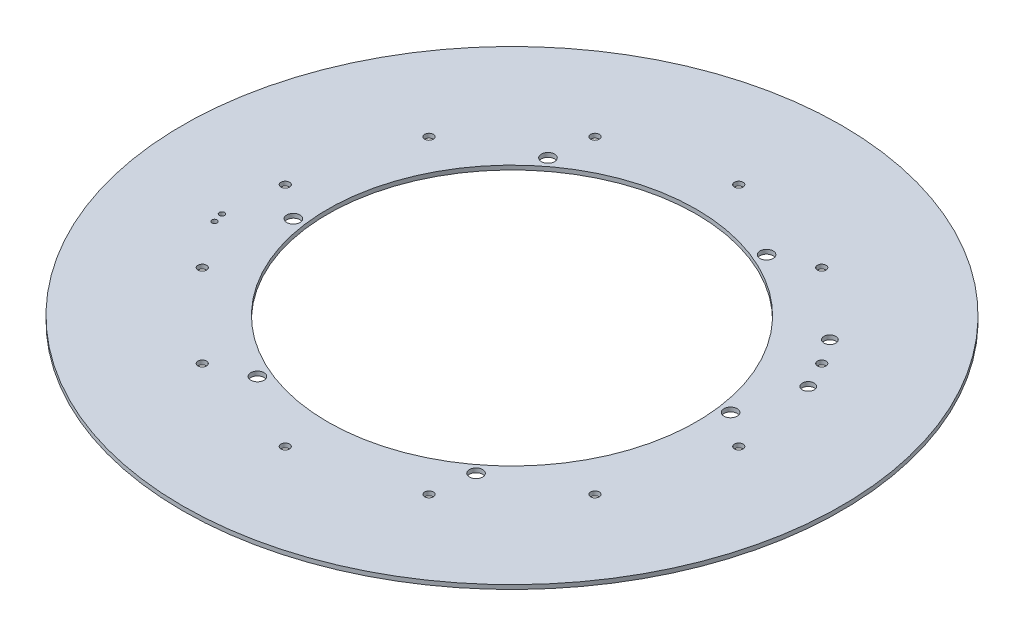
ISO-10303-21;
HEADER;
FILE_DESCRIPTION(('STEP AP214'),'2;1');
FILE_NAME('part.step','',(''),(''),'','','');
FILE_SCHEMA(('AUTOMOTIVE_DESIGN { 1 0 10303 214 1 1 1 1 }'));
ENDSEC;
DATA;
#1=APPLICATION_CONTEXT('core data for automotive mechanical design processes');
#2=APPLICATION_PROTOCOL_DEFINITION('international standard','automotive_design',2000,#1);
#3=PRODUCT_CONTEXT('',#1,'mechanical');
#4=PRODUCT('Part','Part','',(#3));
#5=PRODUCT_RELATED_PRODUCT_CATEGORY('part','',(#4));
#6=PRODUCT_DEFINITION_FORMATION('','',#4);
#7=PRODUCT_DEFINITION_CONTEXT('part definition',#1,'design');
#8=PRODUCT_DEFINITION('design','',#6,#7);
#9=PRODUCT_DEFINITION_SHAPE('','',#8);
#10=(LENGTH_UNIT() NAMED_UNIT(*) SI_UNIT(.MILLI.,.METRE.));
#11=(NAMED_UNIT(*) PLANE_ANGLE_UNIT() SI_UNIT($,.RADIAN.));
#12=(NAMED_UNIT(*) SI_UNIT($,.STERADIAN.) SOLID_ANGLE_UNIT());
#13=UNCERTAINTY_MEASURE_WITH_UNIT(LENGTH_MEASURE(1.E-05),#10,'distance_accuracy_value','');
#14=(GEOMETRIC_REPRESENTATION_CONTEXT(3) GLOBAL_UNCERTAINTY_ASSIGNED_CONTEXT((#13)) GLOBAL_UNIT_ASSIGNED_CONTEXT((#10,
#11,#12)) REPRESENTATION_CONTEXT('',''));
#15=CARTESIAN_POINT('',(0.,0.,0.));
#16=DIRECTION('',(0.,0.,1.));
#17=DIRECTION('',(1.,0.,0.));
#18=AXIS2_PLACEMENT_3D('',#15,#16,#17);
#19=CARTESIAN_POINT('',(0.,1.6,0.));
#20=DIRECTION('',(0.,1.,0.));
#21=DIRECTION('',(0.,0.,1.));
#22=AXIS2_PLACEMENT_3D('',#19,#20,#21);
#23=PLANE('',#22);
#24=CARTESIAN_POINT('',(-88.3956565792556,1.6,21.6149924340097));
#25=DIRECTION('',(0.,1.,0.));
#26=DIRECTION('',(0.,0.,1.));
#27=AXIS2_PLACEMENT_3D('',#24,#25,#26);
#28=CIRCLE('',#27,1.);
#29=CARTESIAN_POINT('',(-88.3956565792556,1.6,22.6149924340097));
#30=VERTEX_POINT('',#29);
#31=EDGE_CURVE('E179',#30,#30,#28,.T.);
#32=ORIENTED_EDGE('',*,*,#31,.F.);
#33=EDGE_LOOP('',(#32));
#34=FACE_BOUND('',#33,.T.);
#35=CARTESIAN_POINT('',(-87.3603803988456,1.6,25.4786957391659));
#36=DIRECTION('',(0.,1.,0.));
#37=DIRECTION('',(0.,0.,1.));
#38=AXIS2_PLACEMENT_3D('',#35,#36,#37);
#39=CIRCLE('',#38,1.);
#40=CARTESIAN_POINT('',(-87.3603803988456,1.6,26.4786957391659));
#41=VERTEX_POINT('',#40);
#42=EDGE_CURVE('E173',#41,#41,#39,.T.);
#43=ORIENTED_EDGE('',*,*,#42,.F.);
#44=EDGE_LOOP('',(#43));
#45=FACE_BOUND('',#44,.T.);
#46=CARTESIAN_POINT('',(79.4536397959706,1.6,-32.9107751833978));
#47=DIRECTION('',(0.,1.,0.));
#48=DIRECTION('',(0.,0.,1.));
#49=AXIS2_PLACEMENT_3D('',#46,#47,#48);
#50=CIRCLE('',#49,2.2479);
#51=CARTESIAN_POINT('',(79.4536397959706,1.6,-30.6628751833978));
#52=VERTEX_POINT('',#51);
#53=EDGE_CURVE('E167',#52,#52,#50,.T.);
#54=ORIENTED_EDGE('',*,*,#53,.F.);
#55=EDGE_LOOP('',(#54));
#56=FACE_BOUND('',#55,.T.);
#57=CARTESIAN_POINT('',(68.2283872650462,1.6,-52.3534828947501));
#58=DIRECTION('',(0.,1.,0.));
#59=DIRECTION('',(0.,0.,1.));
#60=AXIS2_PLACEMENT_3D('',#57,#58,#59);
#61=CIRCLE('',#60,2.2479);
#62=CARTESIAN_POINT('',(68.2283872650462,1.6,-50.1055828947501));
#63=VERTEX_POINT('',#62);
#64=EDGE_CURVE('E161',#63,#63,#61,.T.);
#65=ORIENTED_EDGE('',*,*,#64,.F.);
#66=EDGE_LOOP('',(#65));
#67=FACE_BOUND('',#66,.T.);
#68=CARTESIAN_POINT('',(73.2677752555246,1.6,-9.64588560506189));
#69=DIRECTION('',(0.,1.,0.));
#70=DIRECTION('',(0.,0.,1.));
#71=AXIS2_PLACEMENT_3D('',#68,#69,#70);
#72=CIRCLE('',#71,2.5);
#73=CARTESIAN_POINT('',(73.2677752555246,1.6,-7.14588560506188));
#74=VERTEX_POINT('',#73);
#75=EDGE_CURVE('E155',#74,#74,#72,.T.);
#76=ORIENTED_EDGE('',*,*,#75,.F.);
#77=EDGE_LOOP('',(#76));
#78=FACE_BOUND('',#77,.T.);
#79=CARTESIAN_POINT('',(44.9874696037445,1.6,58.6288118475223));
#80=DIRECTION('',(0.,1.,0.));
#81=DIRECTION('',(0.,0.,1.));
#82=AXIS2_PLACEMENT_3D('',#79,#80,#81);
#83=CIRCLE('',#82,2.5);
#84=CARTESIAN_POINT('',(44.9874696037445,1.6,61.1288118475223));
#85=VERTEX_POINT('',#84);
#86=EDGE_CURVE('E149',#85,#85,#83,.T.);
#87=ORIENTED_EDGE('',*,*,#86,.F.);
#88=EDGE_LOOP('',(#87));
#89=FACE_BOUND('',#88,.T.);
#90=CARTESIAN_POINT('',(-28.2803056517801,1.6,68.2746974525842));
#91=DIRECTION('',(0.,1.,0.));
#92=DIRECTION('',(0.,0.,1.));
#93=AXIS2_PLACEMENT_3D('',#90,#91,#92);
#94=CIRCLE('',#93,2.5);
#95=CARTESIAN_POINT('',(-28.2803056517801,1.6,70.7746974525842));
#96=VERTEX_POINT('',#95);
#97=EDGE_CURVE('E143',#96,#96,#94,.T.);
#98=ORIENTED_EDGE('',*,*,#97,.F.);
#99=EDGE_LOOP('',(#98));
#100=FACE_BOUND('',#99,.T.);
#101=CARTESIAN_POINT('',(-73.2677752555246,1.6,9.64588560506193));
#102=DIRECTION('',(0.,1.,0.));
#103=DIRECTION('',(0.,0.,1.));
#104=AXIS2_PLACEMENT_3D('',#101,#102,#103);
#105=CIRCLE('',#104,2.5);
#106=CARTESIAN_POINT('',(-73.2677752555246,1.6,12.1458856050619));
#107=VERTEX_POINT('',#106);
#108=EDGE_CURVE('E137',#107,#107,#105,.T.);
#109=ORIENTED_EDGE('',*,*,#108,.F.);
#110=EDGE_LOOP('',(#109));
#111=FACE_BOUND('',#110,.T.);
#112=CARTESIAN_POINT('',(-44.9874696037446,1.6,-58.6288118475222));
#113=DIRECTION('',(0.,1.,0.));
#114=DIRECTION('',(0.,0.,1.));
#115=AXIS2_PLACEMENT_3D('',#112,#113,#114);
#116=CIRCLE('',#115,2.5);
#117=CARTESIAN_POINT('',(-44.9874696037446,1.6,-56.1288118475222));
#118=VERTEX_POINT('',#117);
#119=EDGE_CURVE('E131',#118,#118,#116,.T.);
#120=ORIENTED_EDGE('',*,*,#119,.F.);
#121=EDGE_LOOP('',(#120));
#122=FACE_BOUND('',#121,.T.);
#123=CARTESIAN_POINT('',(28.2803056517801,1.6,-68.2746974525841));
#124=DIRECTION('',(0.,1.,0.));
#125=DIRECTION('',(0.,0.,1.));
#126=AXIS2_PLACEMENT_3D('',#123,#124,#125);
#127=CIRCLE('',#126,2.5);
#128=CARTESIAN_POINT('',(28.2803056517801,1.6,-65.7746974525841));
#129=VERTEX_POINT('',#128);
#130=EDGE_CURVE('E125',#129,#129,#127,.T.);
#131=ORIENTED_EDGE('',*,*,#130,.F.);
#132=EDGE_LOOP('',(#131));
#133=FACE_BOUND('',#132,.T.);
#134=CARTESIAN_POINT('',(86.,1.6,0.));
#135=DIRECTION('',(0.,1.,0.));
#136=DIRECTION('',(0.,0.,1.));
#137=AXIS2_PLACEMENT_3D('',#134,#135,#136);
#138=CIRCLE('',#137,1.63194999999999);
#139=CARTESIAN_POINT('',(86.,1.6,1.63194999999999));
#140=VERTEX_POINT('',#139);
#141=EDGE_CURVE('E119',#140,#140,#138,.T.);
#142=ORIENTED_EDGE('',*,*,#141,.F.);
#143=EDGE_LOOP('',(#142));
#144=FACE_BOUND('',#143,.T.);
#145=CARTESIAN_POINT('',(74.4781847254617,1.6,43.));
#146=DIRECTION('',(0.,1.,0.));
#147=DIRECTION('',(0.,0.,1.));
#148=AXIS2_PLACEMENT_3D('',#145,#146,#147);
#149=CIRCLE('',#148,1.63194999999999);
#150=CARTESIAN_POINT('',(74.4781847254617,1.6,44.63195));
#151=VERTEX_POINT('',#150);
#152=EDGE_CURVE('E113',#151,#151,#149,.T.);
#153=ORIENTED_EDGE('',*,*,#152,.F.);
#154=EDGE_LOOP('',(#153));
#155=FACE_BOUND('',#154,.T.);
#156=CARTESIAN_POINT('',(42.9999999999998,1.6,74.4781847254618));
#157=DIRECTION('',(0.,1.,0.));
#158=DIRECTION('',(0.,0.,1.));
#159=AXIS2_PLACEMENT_3D('',#156,#157,#158);
#160=CIRCLE('',#159,1.63194999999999);
#161=CARTESIAN_POINT('',(42.9999999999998,1.6,76.1101347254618));
#162=VERTEX_POINT('',#161);
#163=EDGE_CURVE('E107',#162,#162,#160,.T.);
#164=ORIENTED_EDGE('',*,*,#163,.F.);
#165=EDGE_LOOP('',(#164));
#166=FACE_BOUND('',#165,.T.);
#167=CARTESIAN_POINT('',(-3.00267395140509E-13,1.6,86.));
#168=DIRECTION('',(0.,1.,0.));
#169=DIRECTION('',(0.,0.,1.));
#170=AXIS2_PLACEMENT_3D('',#167,#168,#169);
#171=CIRCLE('',#170,1.63195);
#172=CARTESIAN_POINT('',(-3.00267395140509E-13,1.6,87.63195));
#173=VERTEX_POINT('',#172);
#174=EDGE_CURVE('E101',#173,#173,#171,.T.);
#175=ORIENTED_EDGE('',*,*,#174,.F.);
#176=EDGE_LOOP('',(#175));
#177=FACE_BOUND('',#176,.T.);
#178=CARTESIAN_POINT('',(-43.0000000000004,1.6,74.4781847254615));
#179=DIRECTION('',(0.,1.,0.));
#180=DIRECTION('',(0.,0.,1.));
#181=AXIS2_PLACEMENT_3D('',#178,#179,#180);
#182=CIRCLE('',#181,1.63194999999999);
#183=CARTESIAN_POINT('',(-43.0000000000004,1.6,76.1101347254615));
#184=VERTEX_POINT('',#183);
#185=EDGE_CURVE('E95',#184,#184,#182,.T.);
#186=ORIENTED_EDGE('',*,*,#185,.F.);
#187=EDGE_LOOP('',(#186));
#188=FACE_BOUND('',#187,.T.);
#189=CARTESIAN_POINT('',(-74.4781847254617,1.6,43.));
#190=DIRECTION('',(0.,1.,0.));
#191=DIRECTION('',(0.,0.,1.));
#192=AXIS2_PLACEMENT_3D('',#189,#190,#191);
#193=CIRCLE('',#192,1.63194999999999);
#194=CARTESIAN_POINT('',(-74.4781847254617,1.6,44.63195));
#195=VERTEX_POINT('',#194);
#196=EDGE_CURVE('E89',#195,#195,#193,.T.);
#197=ORIENTED_EDGE('',*,*,#196,.F.);
#198=EDGE_LOOP('',(#197));
#199=FACE_BOUND('',#198,.T.);
#200=CARTESIAN_POINT('',(-86.,1.6,-6.00534790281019E-13));
#201=DIRECTION('',(0.,1.,0.));
#202=DIRECTION('',(0.,0.,1.));
#203=AXIS2_PLACEMENT_3D('',#200,#201,#202);
#204=CIRCLE('',#203,1.63194999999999);
#205=CARTESIAN_POINT('',(-86.,1.6,1.63194999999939));
#206=VERTEX_POINT('',#205);
#207=EDGE_CURVE('E83',#206,#206,#204,.T.);
#208=ORIENTED_EDGE('',*,*,#207,.F.);
#209=EDGE_LOOP('',(#208));
#210=FACE_BOUND('',#209,.T.);
#211=CARTESIAN_POINT('',(-74.4781847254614,1.6,-43.0000000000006));
#212=DIRECTION('',(0.,1.,0.));
#213=DIRECTION('',(0.,0.,1.));
#214=AXIS2_PLACEMENT_3D('',#211,#212,#213);
#215=CIRCLE('',#214,1.63194999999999);
#216=CARTESIAN_POINT('',(-74.4781847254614,1.6,-41.3680500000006));
#217=VERTEX_POINT('',#216);
#218=EDGE_CURVE('E77',#217,#217,#215,.T.);
#219=ORIENTED_EDGE('',*,*,#218,.F.);
#220=EDGE_LOOP('',(#219));
#221=FACE_BOUND('',#220,.T.);
#222=CARTESIAN_POINT('',(-42.9999999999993,1.6,-74.4781847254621));
#223=DIRECTION('',(0.,1.,0.));
#224=DIRECTION('',(0.,0.,1.));
#225=AXIS2_PLACEMENT_3D('',#222,#223,#224);
#226=CIRCLE('',#225,1.63194999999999);
#227=CARTESIAN_POINT('',(-42.9999999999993,1.6,-72.8462347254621));
#228=VERTEX_POINT('',#227);
#229=EDGE_CURVE('E71',#228,#228,#226,.T.);
#230=ORIENTED_EDGE('',*,*,#229,.F.);
#231=EDGE_LOOP('',(#230));
#232=FACE_BOUND('',#231,.T.);
#233=CARTESIAN_POINT('',(9.00802185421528E-13,1.6,-86.));
#234=DIRECTION('',(0.,1.,0.));
#235=DIRECTION('',(0.,0.,1.));
#236=AXIS2_PLACEMENT_3D('',#233,#234,#235);
#237=CIRCLE('',#236,1.63195);
#238=CARTESIAN_POINT('',(9.00802185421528E-13,1.6,-84.36805));
#239=VERTEX_POINT('',#238);
#240=EDGE_CURVE('E65',#239,#239,#237,.T.);
#241=ORIENTED_EDGE('',*,*,#240,.F.);
#242=EDGE_LOOP('',(#241));
#243=FACE_BOUND('',#242,.T.);
#244=CARTESIAN_POINT('',(43.0000000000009,1.6,-74.4781847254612));
#245=DIRECTION('',(0.,1.,0.));
#246=DIRECTION('',(0.,0.,1.));
#247=AXIS2_PLACEMENT_3D('',#244,#245,#246);
#248=CIRCLE('',#247,1.63194999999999);
#249=CARTESIAN_POINT('',(43.0000000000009,1.6,-72.8462347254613));
#250=VERTEX_POINT('',#249);
#251=EDGE_CURVE('E59',#250,#250,#248,.T.);
#252=ORIENTED_EDGE('',*,*,#251,.F.);
#253=EDGE_LOOP('',(#252));
#254=FACE_BOUND('',#253,.T.);
#255=CARTESIAN_POINT('',(74.4781847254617,1.6,-43.));
#256=DIRECTION('',(0.,1.,0.));
#257=DIRECTION('',(0.,0.,1.));
#258=AXIS2_PLACEMENT_3D('',#255,#256,#257);
#259=CIRCLE('',#258,1.63194999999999);
#260=CARTESIAN_POINT('',(74.4781847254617,1.6,-41.36805));
#261=VERTEX_POINT('',#260);
#262=EDGE_CURVE('E53',#261,#261,#259,.T.);
#263=ORIENTED_EDGE('',*,*,#262,.F.);
#264=EDGE_LOOP('',(#263));
#265=FACE_BOUND('',#264,.T.);
#266=CARTESIAN_POINT('',(0.,1.6,0.));
#267=DIRECTION('',(0.,1.,0.));
#268=DIRECTION('',(0.,0.,1.));
#269=AXIS2_PLACEMENT_3D('',#266,#267,#268);
#270=CIRCLE('',#269,125.);
#271=CARTESIAN_POINT('',(0.,1.6,125.));
#272=VERTEX_POINT('',#271);
#273=EDGE_CURVE('E10',#272,#272,#270,.T.);
#274=ORIENTED_EDGE('',*,*,#273,.T.);
#275=EDGE_LOOP('',(#274));
#276=FACE_BOUND('',#275,.T.);
#277=CARTESIAN_POINT('',(0.,1.6,0.));
#278=DIRECTION('',(0.,1.,0.));
#279=DIRECTION('',(0.,0.,1.));
#280=AXIS2_PLACEMENT_3D('',#277,#278,#279);
#281=CIRCLE('',#280,69.9);
#282=CARTESIAN_POINT('',(0.,1.6,69.9));
#283=VERTEX_POINT('',#282);
#284=EDGE_CURVE('E43',#283,#283,#281,.T.);
#285=ORIENTED_EDGE('',*,*,#284,.F.);
#286=EDGE_LOOP('',(#285));
#287=FACE_BOUND('',#286,.T.);
#288=ADVANCED_FACE('F32',(#34,#45,#56,#67,#78,#89,#100,#111,#122,#133,#144,#155,#166,#177,#188,
#199,#210,#221,#232,#243,#254,#265,#276,#287),#23,.T.);
#289=CARTESIAN_POINT('',(0.,0.,0.));
#290=DIRECTION('',(0.,1.,0.));
#291=DIRECTION('',(0.,0.,1.));
#292=AXIS2_PLACEMENT_3D('',#289,#290,#291);
#293=PLANE('',#292);
#294=CARTESIAN_POINT('',(-88.3956565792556,0.,21.6149924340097));
#295=DIRECTION('',(0.,1.,0.));
#296=DIRECTION('',(0.,0.,1.));
#297=AXIS2_PLACEMENT_3D('',#294,#295,#296);
#298=CIRCLE('',#297,1.);
#299=CARTESIAN_POINT('',(-88.3956565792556,0.,22.6149924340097));
#300=VERTEX_POINT('',#299);
#301=EDGE_CURVE('E176',#300,#300,#298,.T.);
#302=ORIENTED_EDGE('',*,*,#301,.T.);
#303=EDGE_LOOP('',(#302));
#304=FACE_BOUND('',#303,.T.);
#305=CARTESIAN_POINT('',(-87.3603803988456,0.,25.4786957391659));
#306=DIRECTION('',(0.,1.,0.));
#307=DIRECTION('',(0.,0.,1.));
#308=AXIS2_PLACEMENT_3D('',#305,#306,#307);
#309=CIRCLE('',#308,1.);
#310=CARTESIAN_POINT('',(-87.3603803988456,0.,26.4786957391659));
#311=VERTEX_POINT('',#310);
#312=EDGE_CURVE('E170',#311,#311,#309,.T.);
#313=ORIENTED_EDGE('',*,*,#312,.T.);
#314=EDGE_LOOP('',(#313));
#315=FACE_BOUND('',#314,.T.);
#316=CARTESIAN_POINT('',(79.4536397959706,0.,-32.9107751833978));
#317=DIRECTION('',(0.,1.,0.));
#318=DIRECTION('',(0.,0.,1.));
#319=AXIS2_PLACEMENT_3D('',#316,#317,#318);
#320=CIRCLE('',#319,2.2479);
#321=CARTESIAN_POINT('',(79.4536397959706,0.,-30.6628751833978));
#322=VERTEX_POINT('',#321);
#323=EDGE_CURVE('E164',#322,#322,#320,.T.);
#324=ORIENTED_EDGE('',*,*,#323,.T.);
#325=EDGE_LOOP('',(#324));
#326=FACE_BOUND('',#325,.T.);
#327=CARTESIAN_POINT('',(68.2283872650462,0.,-52.3534828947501));
#328=DIRECTION('',(0.,1.,0.));
#329=DIRECTION('',(0.,0.,1.));
#330=AXIS2_PLACEMENT_3D('',#327,#328,#329);
#331=CIRCLE('',#330,2.2479);
#332=CARTESIAN_POINT('',(68.2283872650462,0.,-50.1055828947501));
#333=VERTEX_POINT('',#332);
#334=EDGE_CURVE('E158',#333,#333,#331,.T.);
#335=ORIENTED_EDGE('',*,*,#334,.T.);
#336=EDGE_LOOP('',(#335));
#337=FACE_BOUND('',#336,.T.);
#338=CARTESIAN_POINT('',(73.2677752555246,0.,-9.64588560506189));
#339=DIRECTION('',(0.,1.,0.));
#340=DIRECTION('',(0.,0.,1.));
#341=AXIS2_PLACEMENT_3D('',#338,#339,#340);
#342=CIRCLE('',#341,2.5);
#343=CARTESIAN_POINT('',(73.2677752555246,0.,-7.14588560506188));
#344=VERTEX_POINT('',#343);
#345=EDGE_CURVE('E152',#344,#344,#342,.T.);
#346=ORIENTED_EDGE('',*,*,#345,.T.);
#347=EDGE_LOOP('',(#346));
#348=FACE_BOUND('',#347,.T.);
#349=CARTESIAN_POINT('',(44.9874696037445,0.,58.6288118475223));
#350=DIRECTION('',(0.,1.,0.));
#351=DIRECTION('',(0.,0.,1.));
#352=AXIS2_PLACEMENT_3D('',#349,#350,#351);
#353=CIRCLE('',#352,2.5);
#354=CARTESIAN_POINT('',(44.9874696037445,0.,61.1288118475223));
#355=VERTEX_POINT('',#354);
#356=EDGE_CURVE('E146',#355,#355,#353,.T.);
#357=ORIENTED_EDGE('',*,*,#356,.T.);
#358=EDGE_LOOP('',(#357));
#359=FACE_BOUND('',#358,.T.);
#360=CARTESIAN_POINT('',(-28.2803056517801,0.,68.2746974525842));
#361=DIRECTION('',(0.,1.,0.));
#362=DIRECTION('',(0.,0.,1.));
#363=AXIS2_PLACEMENT_3D('',#360,#361,#362);
#364=CIRCLE('',#363,2.5);
#365=CARTESIAN_POINT('',(-28.2803056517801,0.,70.7746974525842));
#366=VERTEX_POINT('',#365);
#367=EDGE_CURVE('E140',#366,#366,#364,.T.);
#368=ORIENTED_EDGE('',*,*,#367,.T.);
#369=EDGE_LOOP('',(#368));
#370=FACE_BOUND('',#369,.T.);
#371=CARTESIAN_POINT('',(-73.2677752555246,0.,9.64588560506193));
#372=DIRECTION('',(0.,1.,0.));
#373=DIRECTION('',(0.,0.,1.));
#374=AXIS2_PLACEMENT_3D('',#371,#372,#373);
#375=CIRCLE('',#374,2.5);
#376=CARTESIAN_POINT('',(-73.2677752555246,0.,12.1458856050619));
#377=VERTEX_POINT('',#376);
#378=EDGE_CURVE('E134',#377,#377,#375,.T.);
#379=ORIENTED_EDGE('',*,*,#378,.T.);
#380=EDGE_LOOP('',(#379));
#381=FACE_BOUND('',#380,.T.);
#382=CARTESIAN_POINT('',(-44.9874696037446,0.,-58.6288118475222));
#383=DIRECTION('',(0.,1.,0.));
#384=DIRECTION('',(0.,0.,1.));
#385=AXIS2_PLACEMENT_3D('',#382,#383,#384);
#386=CIRCLE('',#385,2.5);
#387=CARTESIAN_POINT('',(-44.9874696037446,0.,-56.1288118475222));
#388=VERTEX_POINT('',#387);
#389=EDGE_CURVE('E128',#388,#388,#386,.T.);
#390=ORIENTED_EDGE('',*,*,#389,.T.);
#391=EDGE_LOOP('',(#390));
#392=FACE_BOUND('',#391,.T.);
#393=CARTESIAN_POINT('',(28.2803056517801,0.,-68.2746974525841));
#394=DIRECTION('',(0.,1.,0.));
#395=DIRECTION('',(0.,0.,1.));
#396=AXIS2_PLACEMENT_3D('',#393,#394,#395);
#397=CIRCLE('',#396,2.5);
#398=CARTESIAN_POINT('',(28.2803056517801,0.,-65.7746974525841));
#399=VERTEX_POINT('',#398);
#400=EDGE_CURVE('E122',#399,#399,#397,.T.);
#401=ORIENTED_EDGE('',*,*,#400,.T.);
#402=EDGE_LOOP('',(#401));
#403=FACE_BOUND('',#402,.T.);
#404=CARTESIAN_POINT('',(86.,0.,0.));
#405=DIRECTION('',(0.,1.,0.));
#406=DIRECTION('',(0.,0.,1.));
#407=AXIS2_PLACEMENT_3D('',#404,#405,#406);
#408=CIRCLE('',#407,1.63194999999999);
#409=CARTESIAN_POINT('',(86.,0.,1.63194999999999));
#410=VERTEX_POINT('',#409);
#411=EDGE_CURVE('E116',#410,#410,#408,.T.);
#412=ORIENTED_EDGE('',*,*,#411,.T.);
#413=EDGE_LOOP('',(#412));
#414=FACE_BOUND('',#413,.T.);
#415=CARTESIAN_POINT('',(74.4781847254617,0.,43.));
#416=DIRECTION('',(0.,1.,0.));
#417=DIRECTION('',(0.,0.,1.));
#418=AXIS2_PLACEMENT_3D('',#415,#416,#417);
#419=CIRCLE('',#418,1.63194999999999);
#420=CARTESIAN_POINT('',(74.4781847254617,0.,44.63195));
#421=VERTEX_POINT('',#420);
#422=EDGE_CURVE('E110',#421,#421,#419,.T.);
#423=ORIENTED_EDGE('',*,*,#422,.T.);
#424=EDGE_LOOP('',(#423));
#425=FACE_BOUND('',#424,.T.);
#426=CARTESIAN_POINT('',(42.9999999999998,0.,74.4781847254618));
#427=DIRECTION('',(0.,1.,0.));
#428=DIRECTION('',(0.,0.,1.));
#429=AXIS2_PLACEMENT_3D('',#426,#427,#428);
#430=CIRCLE('',#429,1.63194999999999);
#431=CARTESIAN_POINT('',(42.9999999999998,0.,76.1101347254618));
#432=VERTEX_POINT('',#431);
#433=EDGE_CURVE('E104',#432,#432,#430,.T.);
#434=ORIENTED_EDGE('',*,*,#433,.T.);
#435=EDGE_LOOP('',(#434));
#436=FACE_BOUND('',#435,.T.);
#437=CARTESIAN_POINT('',(-3.00267395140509E-13,0.,86.));
#438=DIRECTION('',(0.,1.,0.));
#439=DIRECTION('',(0.,0.,1.));
#440=AXIS2_PLACEMENT_3D('',#437,#438,#439);
#441=CIRCLE('',#440,1.63195);
#442=CARTESIAN_POINT('',(-3.00267395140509E-13,0.,87.63195));
#443=VERTEX_POINT('',#442);
#444=EDGE_CURVE('E98',#443,#443,#441,.T.);
#445=ORIENTED_EDGE('',*,*,#444,.T.);
#446=EDGE_LOOP('',(#445));
#447=FACE_BOUND('',#446,.T.);
#448=CARTESIAN_POINT('',(-43.0000000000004,0.,74.4781847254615));
#449=DIRECTION('',(0.,1.,0.));
#450=DIRECTION('',(0.,0.,1.));
#451=AXIS2_PLACEMENT_3D('',#448,#449,#450);
#452=CIRCLE('',#451,1.63194999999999);
#453=CARTESIAN_POINT('',(-43.0000000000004,0.,76.1101347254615));
#454=VERTEX_POINT('',#453);
#455=EDGE_CURVE('E92',#454,#454,#452,.T.);
#456=ORIENTED_EDGE('',*,*,#455,.T.);
#457=EDGE_LOOP('',(#456));
#458=FACE_BOUND('',#457,.T.);
#459=CARTESIAN_POINT('',(-74.4781847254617,0.,43.));
#460=DIRECTION('',(0.,1.,0.));
#461=DIRECTION('',(0.,0.,1.));
#462=AXIS2_PLACEMENT_3D('',#459,#460,#461);
#463=CIRCLE('',#462,1.63194999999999);
#464=CARTESIAN_POINT('',(-74.4781847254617,0.,44.63195));
#465=VERTEX_POINT('',#464);
#466=EDGE_CURVE('E86',#465,#465,#463,.T.);
#467=ORIENTED_EDGE('',*,*,#466,.T.);
#468=EDGE_LOOP('',(#467));
#469=FACE_BOUND('',#468,.T.);
#470=CARTESIAN_POINT('',(-86.,0.,-6.00534790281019E-13));
#471=DIRECTION('',(0.,1.,0.));
#472=DIRECTION('',(0.,0.,1.));
#473=AXIS2_PLACEMENT_3D('',#470,#471,#472);
#474=CIRCLE('',#473,1.63194999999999);
#475=CARTESIAN_POINT('',(-86.,0.,1.63194999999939));
#476=VERTEX_POINT('',#475);
#477=EDGE_CURVE('E80',#476,#476,#474,.T.);
#478=ORIENTED_EDGE('',*,*,#477,.T.);
#479=EDGE_LOOP('',(#478));
#480=FACE_BOUND('',#479,.T.);
#481=CARTESIAN_POINT('',(-74.4781847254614,0.,-43.0000000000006));
#482=DIRECTION('',(0.,1.,0.));
#483=DIRECTION('',(0.,0.,1.));
#484=AXIS2_PLACEMENT_3D('',#481,#482,#483);
#485=CIRCLE('',#484,1.63194999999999);
#486=CARTESIAN_POINT('',(-74.4781847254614,0.,-41.3680500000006));
#487=VERTEX_POINT('',#486);
#488=EDGE_CURVE('E74',#487,#487,#485,.T.);
#489=ORIENTED_EDGE('',*,*,#488,.T.);
#490=EDGE_LOOP('',(#489));
#491=FACE_BOUND('',#490,.T.);
#492=CARTESIAN_POINT('',(-42.9999999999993,0.,-74.4781847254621));
#493=DIRECTION('',(0.,1.,0.));
#494=DIRECTION('',(0.,0.,1.));
#495=AXIS2_PLACEMENT_3D('',#492,#493,#494);
#496=CIRCLE('',#495,1.63194999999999);
#497=CARTESIAN_POINT('',(-42.9999999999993,0.,-72.8462347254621));
#498=VERTEX_POINT('',#497);
#499=EDGE_CURVE('E68',#498,#498,#496,.T.);
#500=ORIENTED_EDGE('',*,*,#499,.T.);
#501=EDGE_LOOP('',(#500));
#502=FACE_BOUND('',#501,.T.);
#503=CARTESIAN_POINT('',(9.00802185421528E-13,0.,-86.));
#504=DIRECTION('',(0.,1.,0.));
#505=DIRECTION('',(0.,0.,1.));
#506=AXIS2_PLACEMENT_3D('',#503,#504,#505);
#507=CIRCLE('',#506,1.63195);
#508=CARTESIAN_POINT('',(9.00802185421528E-13,0.,-84.36805));
#509=VERTEX_POINT('',#508);
#510=EDGE_CURVE('E62',#509,#509,#507,.T.);
#511=ORIENTED_EDGE('',*,*,#510,.T.);
#512=EDGE_LOOP('',(#511));
#513=FACE_BOUND('',#512,.T.);
#514=CARTESIAN_POINT('',(43.0000000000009,0.,-74.4781847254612));
#515=DIRECTION('',(0.,1.,0.));
#516=DIRECTION('',(0.,0.,1.));
#517=AXIS2_PLACEMENT_3D('',#514,#515,#516);
#518=CIRCLE('',#517,1.63194999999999);
#519=CARTESIAN_POINT('',(43.0000000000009,0.,-72.8462347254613));
#520=VERTEX_POINT('',#519);
#521=EDGE_CURVE('E56',#520,#520,#518,.T.);
#522=ORIENTED_EDGE('',*,*,#521,.T.);
#523=EDGE_LOOP('',(#522));
#524=FACE_BOUND('',#523,.T.);
#525=CARTESIAN_POINT('',(74.4781847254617,0.,-43.));
#526=DIRECTION('',(0.,1.,0.));
#527=DIRECTION('',(0.,0.,1.));
#528=AXIS2_PLACEMENT_3D('',#525,#526,#527);
#529=CIRCLE('',#528,1.63194999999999);
#530=CARTESIAN_POINT('',(74.4781847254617,0.,-41.36805));
#531=VERTEX_POINT('',#530);
#532=EDGE_CURVE('E48',#531,#531,#529,.T.);
#533=ORIENTED_EDGE('',*,*,#532,.T.);
#534=EDGE_LOOP('',(#533));
#535=FACE_BOUND('',#534,.T.);
#536=CARTESIAN_POINT('',(0.,0.,0.));
#537=DIRECTION('',(0.,1.,0.));
#538=DIRECTION('',(0.,0.,1.));
#539=AXIS2_PLACEMENT_3D('',#536,#537,#538);
#540=CIRCLE('',#539,125.);
#541=CARTESIAN_POINT('',(0.,0.,125.));
#542=VERTEX_POINT('',#541);
#543=EDGE_CURVE('E36',#542,#542,#540,.T.);
#544=ORIENTED_EDGE('',*,*,#543,.F.);
#545=EDGE_LOOP('',(#544));
#546=FACE_BOUND('',#545,.T.);
#547=CARTESIAN_POINT('',(0.,0.,0.));
#548=DIRECTION('',(0.,1.,0.));
#549=DIRECTION('',(0.,0.,1.));
#550=AXIS2_PLACEMENT_3D('',#547,#548,#549);
#551=CIRCLE('',#550,69.9);
#552=CARTESIAN_POINT('',(0.,0.,69.9));
#553=VERTEX_POINT('',#552);
#554=EDGE_CURVE('E45',#553,#553,#551,.T.);
#555=ORIENTED_EDGE('',*,*,#554,.T.);
#556=EDGE_LOOP('',(#555));
#557=FACE_BOUND('',#556,.T.);
#558=ADVANCED_FACE('F187',(#304,#315,#326,#337,#348,#359,#370,#381,#392,#403,#414,#425,#436,
#447,#458,#469,#480,#491,#502,#513,#524,#535,#546,#557),#293,.F.);
#559=CARTESIAN_POINT('',(0.,1.6,0.));
#560=DIRECTION('',(0.,-1.,0.));
#561=DIRECTION('',(0.,0.,-1.));
#562=AXIS2_PLACEMENT_3D('',#559,#560,#561);
#563=CYLINDRICAL_SURFACE('',#562,125.);
#564=ORIENTED_EDGE('',*,*,#273,.F.);
#565=EDGE_LOOP('',(#564));
#566=FACE_BOUND('',#565,.T.);
#567=ORIENTED_EDGE('',*,*,#543,.T.);
#568=EDGE_LOOP('',(#567));
#569=FACE_BOUND('',#568,.T.);
#570=ADVANCED_FACE('F34',(#566,#569),#563,.T.);
#571=CARTESIAN_POINT('',(0.,1.6,0.));
#572=DIRECTION('',(0.,-1.,0.));
#573=DIRECTION('',(0.,0.,-1.));
#574=AXIS2_PLACEMENT_3D('',#571,#572,#573);
#575=CYLINDRICAL_SURFACE('',#574,69.9);
#576=ORIENTED_EDGE('',*,*,#284,.T.);
#577=EDGE_LOOP('',(#576));
#578=FACE_BOUND('',#577,.T.);
#579=ORIENTED_EDGE('',*,*,#554,.F.);
#580=EDGE_LOOP('',(#579));
#581=FACE_BOUND('',#580,.T.);
#582=ADVANCED_FACE('F233',(#578,#581),#575,.F.);
#583=CARTESIAN_POINT('',(74.4781847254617,1.6,-43.));
#584=DIRECTION('',(0.,1.,0.));
#585=DIRECTION('',(0.,0.,1.));
#586=AXIS2_PLACEMENT_3D('',#583,#584,#585);
#587=CYLINDRICAL_SURFACE('',#586,1.63194999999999);
#588=ORIENTED_EDGE('',*,*,#532,.F.);
#589=EDGE_LOOP('',(#588));
#590=FACE_BOUND('',#589,.T.);
#591=ORIENTED_EDGE('',*,*,#262,.T.);
#592=EDGE_LOOP('',(#591));
#593=FACE_BOUND('',#592,.T.);
#594=ADVANCED_FACE('F236',(#590,#593),#587,.F.);
#595=CARTESIAN_POINT('',(43.0000000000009,1.6,-74.4781847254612));
#596=DIRECTION('',(0.,1.,0.));
#597=DIRECTION('',(0.,0.,1.));
#598=AXIS2_PLACEMENT_3D('',#595,#596,#597);
#599=CYLINDRICAL_SURFACE('',#598,1.63194999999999);
#600=ORIENTED_EDGE('',*,*,#521,.F.);
#601=EDGE_LOOP('',(#600));
#602=FACE_BOUND('',#601,.T.);
#603=ORIENTED_EDGE('',*,*,#251,.T.);
#604=EDGE_LOOP('',(#603));
#605=FACE_BOUND('',#604,.T.);
#606=ADVANCED_FACE('F250',(#602,#605),#599,.F.);
#607=CARTESIAN_POINT('',(9.00802185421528E-13,1.6,-86.));
#608=DIRECTION('',(0.,1.,0.));
#609=DIRECTION('',(0.,0.,1.));
#610=AXIS2_PLACEMENT_3D('',#607,#608,#609);
#611=CYLINDRICAL_SURFACE('',#610,1.63195);
#612=ORIENTED_EDGE('',*,*,#510,.F.);
#613=EDGE_LOOP('',(#612));
#614=FACE_BOUND('',#613,.T.);
#615=ORIENTED_EDGE('',*,*,#240,.T.);
#616=EDGE_LOOP('',(#615));
#617=FACE_BOUND('',#616,.T.);
#618=ADVANCED_FACE('F254',(#614,#617),#611,.F.);
#619=CARTESIAN_POINT('',(-42.9999999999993,1.6,-74.4781847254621));
#620=DIRECTION('',(0.,1.,0.));
#621=DIRECTION('',(0.,0.,1.));
#622=AXIS2_PLACEMENT_3D('',#619,#620,#621);
#623=CYLINDRICAL_SURFACE('',#622,1.63194999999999);
#624=ORIENTED_EDGE('',*,*,#499,.F.);
#625=EDGE_LOOP('',(#624));
#626=FACE_BOUND('',#625,.T.);
#627=ORIENTED_EDGE('',*,*,#229,.T.);
#628=EDGE_LOOP('',(#627));
#629=FACE_BOUND('',#628,.T.);
#630=ADVANCED_FACE('F258',(#626,#629),#623,.F.);
#631=CARTESIAN_POINT('',(-74.4781847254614,1.6,-43.0000000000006));
#632=DIRECTION('',(0.,1.,0.));
#633=DIRECTION('',(0.,0.,1.));
#634=AXIS2_PLACEMENT_3D('',#631,#632,#633);
#635=CYLINDRICAL_SURFACE('',#634,1.63194999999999);
#636=ORIENTED_EDGE('',*,*,#488,.F.);
#637=EDGE_LOOP('',(#636));
#638=FACE_BOUND('',#637,.T.);
#639=ORIENTED_EDGE('',*,*,#218,.T.);
#640=EDGE_LOOP('',(#639));
#641=FACE_BOUND('',#640,.T.);
#642=ADVANCED_FACE('F262',(#638,#641),#635,.F.);
#643=CARTESIAN_POINT('',(-86.,1.6,-6.00534790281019E-13));
#644=DIRECTION('',(0.,1.,0.));
#645=DIRECTION('',(0.,0.,1.));
#646=AXIS2_PLACEMENT_3D('',#643,#644,#645);
#647=CYLINDRICAL_SURFACE('',#646,1.63194999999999);
#648=ORIENTED_EDGE('',*,*,#477,.F.);
#649=EDGE_LOOP('',(#648));
#650=FACE_BOUND('',#649,.T.);
#651=ORIENTED_EDGE('',*,*,#207,.T.);
#652=EDGE_LOOP('',(#651));
#653=FACE_BOUND('',#652,.T.);
#654=ADVANCED_FACE('F266',(#650,#653),#647,.F.);
#655=CARTESIAN_POINT('',(-74.4781847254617,1.6,43.));
#656=DIRECTION('',(0.,1.,0.));
#657=DIRECTION('',(0.,0.,1.));
#658=AXIS2_PLACEMENT_3D('',#655,#656,#657);
#659=CYLINDRICAL_SURFACE('',#658,1.63194999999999);
#660=ORIENTED_EDGE('',*,*,#466,.F.);
#661=EDGE_LOOP('',(#660));
#662=FACE_BOUND('',#661,.T.);
#663=ORIENTED_EDGE('',*,*,#196,.T.);
#664=EDGE_LOOP('',(#663));
#665=FACE_BOUND('',#664,.T.);
#666=ADVANCED_FACE('F270',(#662,#665),#659,.F.);
#667=CARTESIAN_POINT('',(-43.0000000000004,1.6,74.4781847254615));
#668=DIRECTION('',(0.,1.,0.));
#669=DIRECTION('',(0.,0.,1.));
#670=AXIS2_PLACEMENT_3D('',#667,#668,#669);
#671=CYLINDRICAL_SURFACE('',#670,1.63194999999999);
#672=ORIENTED_EDGE('',*,*,#455,.F.);
#673=EDGE_LOOP('',(#672));
#674=FACE_BOUND('',#673,.T.);
#675=ORIENTED_EDGE('',*,*,#185,.T.);
#676=EDGE_LOOP('',(#675));
#677=FACE_BOUND('',#676,.T.);
#678=ADVANCED_FACE('F274',(#674,#677),#671,.F.);
#679=CARTESIAN_POINT('',(-3.00267395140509E-13,1.6,86.));
#680=DIRECTION('',(0.,1.,0.));
#681=DIRECTION('',(0.,0.,1.));
#682=AXIS2_PLACEMENT_3D('',#679,#680,#681);
#683=CYLINDRICAL_SURFACE('',#682,1.63195);
#684=ORIENTED_EDGE('',*,*,#444,.F.);
#685=EDGE_LOOP('',(#684));
#686=FACE_BOUND('',#685,.T.);
#687=ORIENTED_EDGE('',*,*,#174,.T.);
#688=EDGE_LOOP('',(#687));
#689=FACE_BOUND('',#688,.T.);
#690=ADVANCED_FACE('F278',(#686,#689),#683,.F.);
#691=CARTESIAN_POINT('',(42.9999999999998,1.6,74.4781847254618));
#692=DIRECTION('',(0.,1.,0.));
#693=DIRECTION('',(0.,0.,1.));
#694=AXIS2_PLACEMENT_3D('',#691,#692,#693);
#695=CYLINDRICAL_SURFACE('',#694,1.63194999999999);
#696=ORIENTED_EDGE('',*,*,#433,.F.);
#697=EDGE_LOOP('',(#696));
#698=FACE_BOUND('',#697,.T.);
#699=ORIENTED_EDGE('',*,*,#163,.T.);
#700=EDGE_LOOP('',(#699));
#701=FACE_BOUND('',#700,.T.);
#702=ADVANCED_FACE('F282',(#698,#701),#695,.F.);
#703=CARTESIAN_POINT('',(74.4781847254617,1.6,43.));
#704=DIRECTION('',(0.,1.,0.));
#705=DIRECTION('',(0.,0.,1.));
#706=AXIS2_PLACEMENT_3D('',#703,#704,#705);
#707=CYLINDRICAL_SURFACE('',#706,1.63194999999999);
#708=ORIENTED_EDGE('',*,*,#422,.F.);
#709=EDGE_LOOP('',(#708));
#710=FACE_BOUND('',#709,.T.);
#711=ORIENTED_EDGE('',*,*,#152,.T.);
#712=EDGE_LOOP('',(#711));
#713=FACE_BOUND('',#712,.T.);
#714=ADVANCED_FACE('F286',(#710,#713),#707,.F.);
#715=CARTESIAN_POINT('',(86.,1.6,0.));
#716=DIRECTION('',(0.,1.,0.));
#717=DIRECTION('',(0.,0.,1.));
#718=AXIS2_PLACEMENT_3D('',#715,#716,#717);
#719=CYLINDRICAL_SURFACE('',#718,1.63194999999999);
#720=ORIENTED_EDGE('',*,*,#411,.F.);
#721=EDGE_LOOP('',(#720));
#722=FACE_BOUND('',#721,.T.);
#723=ORIENTED_EDGE('',*,*,#141,.T.);
#724=EDGE_LOOP('',(#723));
#725=FACE_BOUND('',#724,.T.);
#726=ADVANCED_FACE('F290',(#722,#725),#719,.F.);
#727=CARTESIAN_POINT('',(28.2803056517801,1.6,-68.2746974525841));
#728=DIRECTION('',(0.,1.,0.));
#729=DIRECTION('',(0.,0.,1.));
#730=AXIS2_PLACEMENT_3D('',#727,#728,#729);
#731=CYLINDRICAL_SURFACE('',#730,2.5);
#732=ORIENTED_EDGE('',*,*,#400,.F.);
#733=EDGE_LOOP('',(#732));
#734=FACE_BOUND('',#733,.T.);
#735=ORIENTED_EDGE('',*,*,#130,.T.);
#736=EDGE_LOOP('',(#735));
#737=FACE_BOUND('',#736,.T.);
#738=ADVANCED_FACE('F294',(#734,#737),#731,.F.);
#739=CARTESIAN_POINT('',(-44.9874696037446,1.6,-58.6288118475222));
#740=DIRECTION('',(0.,1.,0.));
#741=DIRECTION('',(0.,0.,1.));
#742=AXIS2_PLACEMENT_3D('',#739,#740,#741);
#743=CYLINDRICAL_SURFACE('',#742,2.5);
#744=ORIENTED_EDGE('',*,*,#389,.F.);
#745=EDGE_LOOP('',(#744));
#746=FACE_BOUND('',#745,.T.);
#747=ORIENTED_EDGE('',*,*,#119,.T.);
#748=EDGE_LOOP('',(#747));
#749=FACE_BOUND('',#748,.T.);
#750=ADVANCED_FACE('F298',(#746,#749),#743,.F.);
#751=CARTESIAN_POINT('',(-73.2677752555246,1.6,9.64588560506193));
#752=DIRECTION('',(0.,1.,0.));
#753=DIRECTION('',(0.,0.,1.));
#754=AXIS2_PLACEMENT_3D('',#751,#752,#753);
#755=CYLINDRICAL_SURFACE('',#754,2.5);
#756=ORIENTED_EDGE('',*,*,#378,.F.);
#757=EDGE_LOOP('',(#756));
#758=FACE_BOUND('',#757,.T.);
#759=ORIENTED_EDGE('',*,*,#108,.T.);
#760=EDGE_LOOP('',(#759));
#761=FACE_BOUND('',#760,.T.);
#762=ADVANCED_FACE('F302',(#758,#761),#755,.F.);
#763=CARTESIAN_POINT('',(-28.2803056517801,1.6,68.2746974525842));
#764=DIRECTION('',(0.,1.,0.));
#765=DIRECTION('',(0.,0.,1.));
#766=AXIS2_PLACEMENT_3D('',#763,#764,#765);
#767=CYLINDRICAL_SURFACE('',#766,2.5);
#768=ORIENTED_EDGE('',*,*,#367,.F.);
#769=EDGE_LOOP('',(#768));
#770=FACE_BOUND('',#769,.T.);
#771=ORIENTED_EDGE('',*,*,#97,.T.);
#772=EDGE_LOOP('',(#771));
#773=FACE_BOUND('',#772,.T.);
#774=ADVANCED_FACE('F306',(#770,#773),#767,.F.);
#775=CARTESIAN_POINT('',(44.9874696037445,1.6,58.6288118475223));
#776=DIRECTION('',(0.,1.,0.));
#777=DIRECTION('',(0.,0.,1.));
#778=AXIS2_PLACEMENT_3D('',#775,#776,#777);
#779=CYLINDRICAL_SURFACE('',#778,2.5);
#780=ORIENTED_EDGE('',*,*,#356,.F.);
#781=EDGE_LOOP('',(#780));
#782=FACE_BOUND('',#781,.T.);
#783=ORIENTED_EDGE('',*,*,#86,.T.);
#784=EDGE_LOOP('',(#783));
#785=FACE_BOUND('',#784,.T.);
#786=ADVANCED_FACE('F310',(#782,#785),#779,.F.);
#787=CARTESIAN_POINT('',(73.2677752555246,1.6,-9.64588560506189));
#788=DIRECTION('',(0.,1.,0.));
#789=DIRECTION('',(0.,0.,1.));
#790=AXIS2_PLACEMENT_3D('',#787,#788,#789);
#791=CYLINDRICAL_SURFACE('',#790,2.5);
#792=ORIENTED_EDGE('',*,*,#345,.F.);
#793=EDGE_LOOP('',(#792));
#794=FACE_BOUND('',#793,.T.);
#795=ORIENTED_EDGE('',*,*,#75,.T.);
#796=EDGE_LOOP('',(#795));
#797=FACE_BOUND('',#796,.T.);
#798=ADVANCED_FACE('F314',(#794,#797),#791,.F.);
#799=CARTESIAN_POINT('',(68.2283872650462,1.6,-52.3534828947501));
#800=DIRECTION('',(0.,1.,0.));
#801=DIRECTION('',(0.,0.,1.));
#802=AXIS2_PLACEMENT_3D('',#799,#800,#801);
#803=CYLINDRICAL_SURFACE('',#802,2.2479);
#804=ORIENTED_EDGE('',*,*,#334,.F.);
#805=EDGE_LOOP('',(#804));
#806=FACE_BOUND('',#805,.T.);
#807=ORIENTED_EDGE('',*,*,#64,.T.);
#808=EDGE_LOOP('',(#807));
#809=FACE_BOUND('',#808,.T.);
#810=ADVANCED_FACE('F318',(#806,#809),#803,.F.);
#811=CARTESIAN_POINT('',(79.4536397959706,1.6,-32.9107751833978));
#812=DIRECTION('',(0.,1.,0.));
#813=DIRECTION('',(0.,0.,1.));
#814=AXIS2_PLACEMENT_3D('',#811,#812,#813);
#815=CYLINDRICAL_SURFACE('',#814,2.2479);
#816=ORIENTED_EDGE('',*,*,#323,.F.);
#817=EDGE_LOOP('',(#816));
#818=FACE_BOUND('',#817,.T.);
#819=ORIENTED_EDGE('',*,*,#53,.T.);
#820=EDGE_LOOP('',(#819));
#821=FACE_BOUND('',#820,.T.);
#822=ADVANCED_FACE('F322',(#818,#821),#815,.F.);
#823=CARTESIAN_POINT('',(-87.3603803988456,1.6,25.4786957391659));
#824=DIRECTION('',(0.,1.,0.));
#825=DIRECTION('',(0.,0.,1.));
#826=AXIS2_PLACEMENT_3D('',#823,#824,#825);
#827=CYLINDRICAL_SURFACE('',#826,1.);
#828=ORIENTED_EDGE('',*,*,#312,.F.);
#829=EDGE_LOOP('',(#828));
#830=FACE_BOUND('',#829,.T.);
#831=ORIENTED_EDGE('',*,*,#42,.T.);
#832=EDGE_LOOP('',(#831));
#833=FACE_BOUND('',#832,.T.);
#834=ADVANCED_FACE('F326',(#830,#833),#827,.F.);
#835=CARTESIAN_POINT('',(-88.3956565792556,1.6,21.6149924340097));
#836=DIRECTION('',(0.,1.,0.));
#837=DIRECTION('',(0.,0.,1.));
#838=AXIS2_PLACEMENT_3D('',#835,#836,#837);
#839=CYLINDRICAL_SURFACE('',#838,1.);
#840=ORIENTED_EDGE('',*,*,#301,.F.);
#841=EDGE_LOOP('',(#840));
#842=FACE_BOUND('',#841,.T.);
#843=ORIENTED_EDGE('',*,*,#31,.T.);
#844=EDGE_LOOP('',(#843));
#845=FACE_BOUND('',#844,.T.);
#846=ADVANCED_FACE('F183',(#842,#845),#839,.F.);
#847=CLOSED_SHELL('',(#288,#558,#570,#582,#594,#606,#618,#630,#642,#654,#666,#678,#690,#702,
#714,#726,#738,#750,#762,#774,#786,#798,#810,#822,#834,#846));
#848=MANIFOLD_SOLID_BREP('B2',#847);
#849=ADVANCED_BREP_SHAPE_REPRESENTATION('',(#18,#848),#14);
#850=SHAPE_DEFINITION_REPRESENTATION(#9,#849);
ENDSEC;
END-ISO-10303-21;
